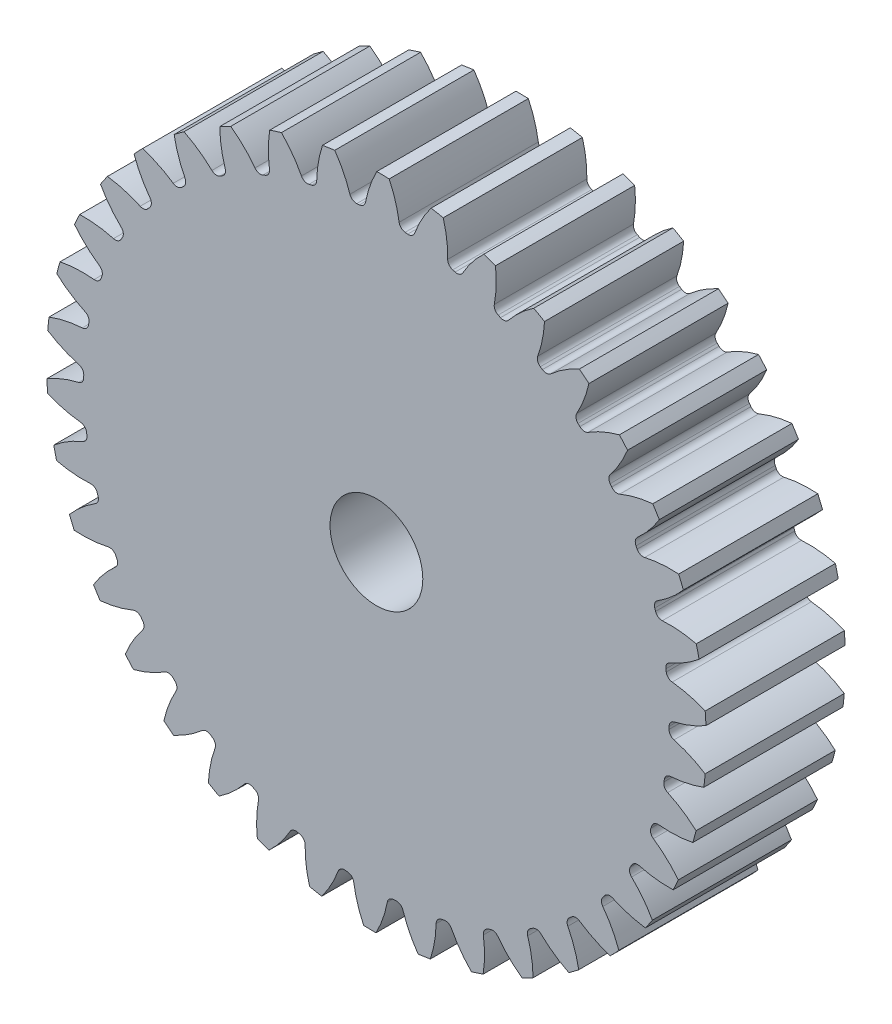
from build123d import *

# Parameters (mm, degrees)
SKETCH3_R         = 225.777777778
GEARBODY_DEPTH    = 95.25
TOOTHCUT_DEPTH    = 334.202299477
CIRPATTERN1_COUNT = 38
BOREDIA_R         = 31.75
BORE_DEPTH        = 12700


with BuildPart() as part:
    # Sketch3 → gearBody (new body)
    with BuildSketch(Plane.XY):
        Circle(SKETCH3_R)
    extrude(amount=GEARBODY_DEPTH)

    # Sketch2 → toothCut (cut, through all)
    with BuildSketch(Plane.XY):
        with BuildLine():
            ThreePointArc((200.318383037, -4.878446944), (200.338051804, -3.989840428), (200.353778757, -3.101155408))
            ThreePointArc((200.353778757, -3.101155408), (201.370934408, -0.288493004), (203.903832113, 1.302137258))
            ThreePointArc((203.903832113, 1.302137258), (215.174303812, 4.852458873), (225.777777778, 10.067308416))
            ThreePointArc((225.777777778, 10.067308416), (225.957308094, -4.500061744), (225.197916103, -19.04873276))
            ThreePointArc((225.197916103, -19.04873276), (214.810480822, -13.41583793), (203.69030304, -9.419594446))
            ThreePointArc((203.69030304, -9.419594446), (201.222745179, -7.729377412), (200.318383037, -4.878446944))
        make_face()
    toothcut = extrude(amount=TOOTHCUT_DEPTH, mode=Mode.SUBTRACT)

    # CirPattern1: toothCut ×38 about axis
    cirpattern1_axis = Axis((0, 0, 0), (0, 0, 1))
    for i in range(1, CIRPATTERN1_COUNT):
        add(toothcut.rotate(cirpattern1_axis, i * 360 / CIRPATTERN1_COUNT), mode=Mode.SUBTRACT)

    # boreDia → bore (cut, symmetric)
    with BuildSketch(Plane.XY):
        Circle(BOREDIA_R)
    extrude(amount=BORE_DEPTH, both=True, mode=Mode.SUBTRACT)


solid = part.part
